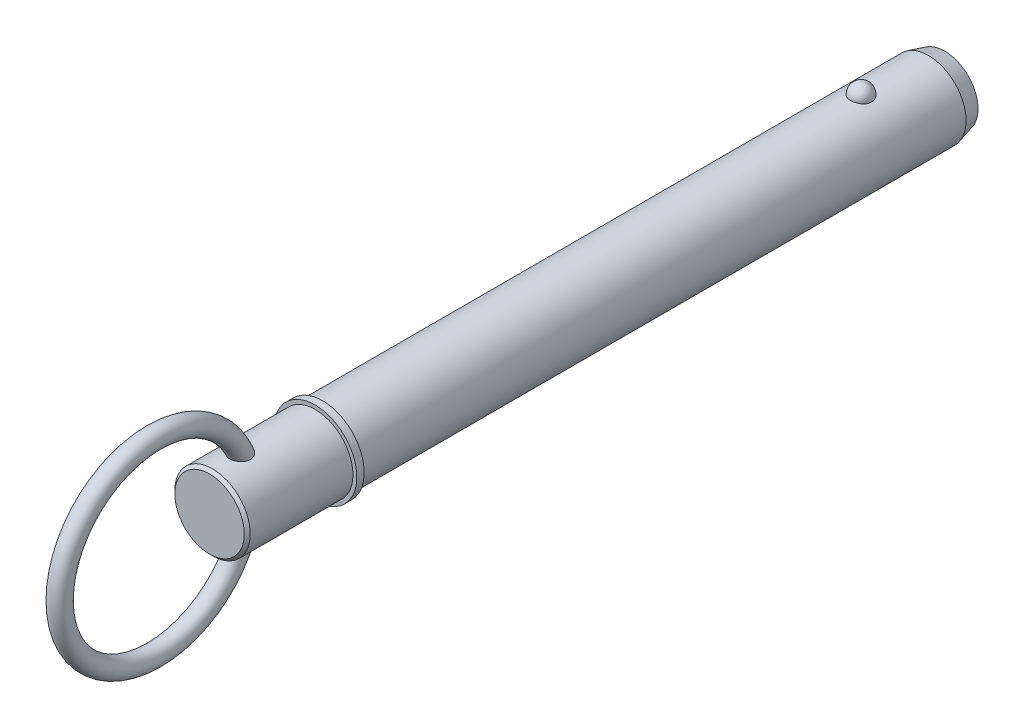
from build123d import *

# Parameters (mm, degrees)
SKETCH2_R           = 12.7
BOSS_EXTRUDE1_DEPTH = 177.8
BOSS_EXTRUDE2_START = 31.75
SKETCH3_R           = 12.7
BOSS_EXTRUDE2_DEPTH = 31.75
CHAMFER1_SIZE       = 5.5
CHAMFER1_SIZE2      = 1.473720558
SKETCH20_W          = 2.5
SKETCH20_H          = 14
SKETCH21_R          = 12.7
BOSS_EXTRUDE3_DEPTH = 38.1
CHAMFER2_SIZE       = 1
SKETCH24_R          = 3.25


with BuildPart() as part:
    # Sketch2 → Boss-Extrude1 (new body)
    with BuildSketch(Plane.XY):
        Circle(SKETCH2_R)
    extrude(amount=BOSS_EXTRUDE1_DEPTH)

    # Sketch3 → Boss-Extrude2 (add)
    with BuildSketch(Plane(origin=(0, 0, 0), x_dir=(-1, 0, 0), z_dir=(0, 0, -1)).offset(BOSS_EXTRUDE2_START)):
        Circle(SKETCH3_R)
    extrude(amount=-BOSS_EXTRUDE2_DEPTH)

    # Chamfer1
    chamfer1_edges = [part.edges().sort_by_distance(p)[0] for p in [
        (12.7, 0, -31.75),
    ]]
    chamfer1_side = [part.faces().sort_by_distance(p)[0] for p in [
        (12.7, 0, -15.875),
    ]]
    chamfer(chamfer1_edges, length=CHAMFER1_SIZE, length2=CHAMFER1_SIZE2, reference=chamfer1_side[0])

    # Sketch18 → Revolve1 (revolve)
    with BuildSketch(Plane(origin=(0, 0, 0), x_dir=(0, 0, -1), z_dir=(1, 0, 0))):
        with BuildLine():
            Line((3.56, 16.26), (3.56, 9.14))
            ThreePointArc((3.56, 9.14), (0, 12.7), (3.56, 16.26))
        make_face()
    revolve(axis=Axis((0, 16.26, -3.56), (0, -1, 0)))

    # Sketch20 → Revolve2 (revolve)
    with BuildSketch(Plane(origin=(0, 0, 0), x_dir=(0, 0, -1), z_dir=(1, 0, 0)), mode=Mode.PRIVATE) as revolve2_sk:
        with Locations((-179.05, 7)):
            Rectangle(SKETCH20_W, SKETCH20_H)
    revolve(revolve2_sk.sketch.rotate(Axis((0, 0, 33.728787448), (0, 0, 1)), 90), axis=Axis((0, 0, 33.728787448), (0, 0, 1)))

    # Sketch21 → Boss-Extrude3 (add)
    with BuildSketch(Plane(origin=(0, 0, 177.8), x_dir=(-1, 0, 0), z_dir=(0, 0, -1))):
        Circle(SKETCH21_R)
    extrude(amount=-BOSS_EXTRUDE3_DEPTH)

    # Chamfer2
    chamfer2_edges = [part.edges().sort_by_distance(p)[0] for p in [
        (12.7, 0, 215.9),
    ]]
    chamfer(chamfer2_edges, length=CHAMFER2_SIZE)

    # Sweep1: sweep along a path in Sketch23
    with BuildLine(Plane(origin=(0, 0, 0), x_dir=(0, 0, -1), z_dir=(1, 0, 0))) as sweep1_path:
        CenterArc((-234.65, 0), 31.75, 0, 360)
    # Sketch24 → Sweep1 (sweep)
    with BuildSketch(Plane(origin=(0, 0, 0), x_dir=(1, 0, 0), z_dir=(0, 1, 0))):
        with Locations((0, -202.9)):
            Circle(SKETCH24_R)
    sweep(path=sweep1_path.line)


solid = part.part
